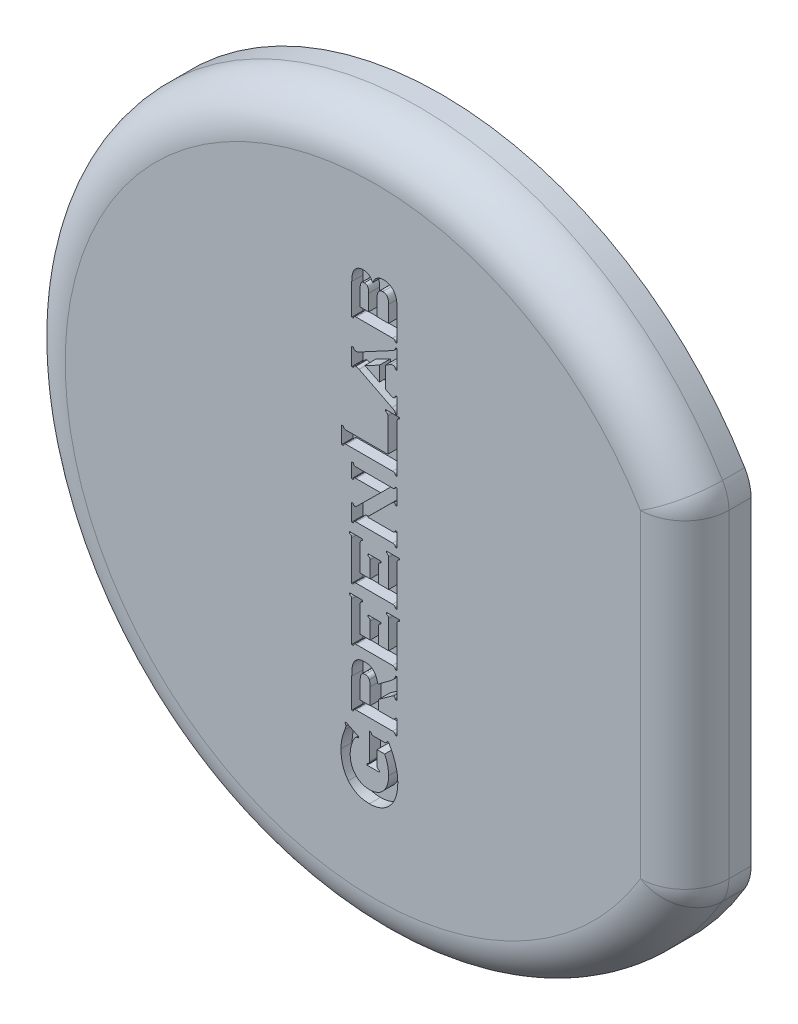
from build123d import *

# Parameters (mm, degrees)
BOSS_EXTRUDE1_DEPTH = 3
FILLET1_R           = 2
CUT_EXTRUDE1_DEPTH  = 0.5


with BuildPart() as part:
    # Sketch1 → Boss-Extrude1 (new body)
    with BuildSketch(Plane.XY.offset(3)):
        with BuildLine():
            Line((13.99999987, -7.745966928), (13.99999987, 7.745966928))
            ThreePointArc((13.99999987, 7.745966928), (-16, 0), (13.99999987, -7.745966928))
        make_face()
    extrude(amount=-BOSS_EXTRUDE1_DEPTH)

    # Fillet1
    fillet1_edges = [part.edges().sort_by_distance(p)[0] for p in [
        (13.99999987, 0, 3),
        (-16, 0, 3),
        (13.99999987, 7.745966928, 1.5),
        (13.99999987, -7.745966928, 1.5),
    ]]
    fillet(fillet1_edges, radius=FILLET1_R)

    # Sketch2 → Cut-Extrude1 (cut)
    # profile 1 of 8: a face of its own
    with BuildSketch(Plane.XY.offset(3)):
        with BuildLine():
            add(Edge.make_bspline(
                [(-0.100260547, 10.073784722), (-0.089010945, 10.097643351), (-0.067808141, 10.142611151), (-0.033016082, 10.203527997), (0.001276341, 10.254862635), (0.026751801, 10.283442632), (0.038628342, 10.296766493)],
                knots=[0, 0, 0, 0, 1.199284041, 2.260363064, 3.188989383, 4, 4, 4, 4], degree=3))
            add(Edge.make_bspline(
                [(0.038628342, 10.296766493), (0.049797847, 10.307685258), (0.072148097, 10.329533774), (0.109592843, 10.357737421), (0.150282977, 10.380996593), (0.193106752, 10.400928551), (0.239354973, 10.415332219), (0.28813888, 10.426235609), (0.339917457, 10.432843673), (0.375342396, 10.433627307), (0.39344605, 10.434027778)],
                knots=[0, 0, 0, 0, 0.957204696, 1.915372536, 2.864513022, 3.827290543, 4.805779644, 5.828215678, 6.89012558, 8, 8, 8, 8], degree=3))
            add(Edge.make_bspline(
                [(0.39344605, 10.434027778), (0.417720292, 10.433485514), (0.46505451, 10.432428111), (0.534000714, 10.421763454), (0.598795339, 10.404776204), (0.659040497, 10.379794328), (0.715409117, 10.349147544), (0.76679019, 10.310325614), (0.814590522, 10.265336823), (0.841835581, 10.230422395), (0.855685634, 10.212673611)],
                knots=[0, 0, 0, 0, 1.09149512, 2.128390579, 3.131133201, 4.098244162, 5.056171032, 6.009871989, 6.988316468, 8, 8, 8, 8], degree=3))
            add(Edge.make_bspline(
                [(0.855685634, 10.212673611), (0.867269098, 10.195719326), (0.890818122, 10.1612515), (0.91971378, 10.104415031), (0.944739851, 10.043451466), (0.965471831, 9.977997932), (0.98117097, 9.907740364), (0.99145066, 9.832766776), (0.999057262, 9.753300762), (0.999679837, 9.69873222), (0.99999987, 9.670681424)],
                knots=[0, 0, 0, 0, 0.863603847, 1.755694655, 2.67743618, 3.635676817, 4.642232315, 5.703768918, 6.81962927, 8, 8, 8, 8], degree=3))
            Line((0.99999987, 9.670681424), (0.99999987, 8.246527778))
            Line((0.99999987, 8.246527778), (0.930555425, 8.246527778))
            add(Edge.make_bspline(
                [(0.930555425, 8.246527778), (0.927624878, 8.255432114), (0.92214104, 8.272094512), (0.91220566, 8.29512164), (0.898959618, 8.312950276), (0.88435864, 8.327490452), (0.866809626, 8.337941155), (0.846629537, 8.345530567), (0.823124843, 8.349789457), (0.806513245, 8.350379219), (0.797634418, 8.350694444)],
                knots=[0, 0, 0, 0, 1.214308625, 2.272296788, 3.227641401, 4.072125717, 4.923398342, 5.849609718, 6.850625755, 8, 8, 8, 8], degree=3))
            Line((0.797634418, 8.350694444), (-0.84624579, 8.350694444))
            add(Edge.make_bspline(
                [(-0.84624579, 8.350694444), (-0.854925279, 8.350287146), (-0.871289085, 8.34951925), (-0.894640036, 8.3463678), (-0.914166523, 8.338319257), (-0.931547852, 8.328655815), (-0.945395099, 8.313813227), (-0.958696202, 8.295899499), (-0.969741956, 8.272713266), (-0.975891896, 8.255626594), (-0.979166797, 8.246527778)],
                knots=[0, 0, 0, 0, 1.128659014, 2.127908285, 3.03439063, 3.855433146, 4.685150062, 5.642745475, 6.744739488, 8, 8, 8, 8], degree=3))
            Line((-0.979166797, 8.246527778), (-1.048611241, 8.246527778))
            Line((-1.048611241, 8.246527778), (-1.048611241, 9.644097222))
            add(Edge.make_bspline(
                [(-1.048611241, 9.644097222), (-1.048249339, 9.673771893), (-1.047551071, 9.731027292), (-1.040687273, 9.813757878), (-1.031012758, 9.890568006), (-1.015611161, 9.961009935), (-0.996966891, 10.025633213), (-0.973377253, 10.08376899), (-0.946823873, 10.136854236), (-0.924088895, 10.167739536), (-0.912977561, 10.182834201)],
                knots=[0, 0, 0, 0, 1.259629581, 2.430375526, 3.522812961, 4.543893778, 5.488959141, 6.374407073, 7.205519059, 8, 8, 8, 8], degree=3))
            add(Edge.make_bspline(
                [(-0.912977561, 10.182834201), (-0.900839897, 10.197437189), (-0.876987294, 10.226134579), (-0.835830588, 10.263196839), (-0.791494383, 10.294406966), (-0.743941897, 10.320010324), (-0.693076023, 10.340467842), (-0.638655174, 10.354098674), (-0.58107891, 10.36332541), (-0.541560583, 10.364156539), (-0.521267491, 10.364583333)],
                knots=[0, 0, 0, 0, 1.01613969, 1.996889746, 2.956405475, 3.914354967, 4.883989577, 5.884961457, 6.913904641, 8, 8, 8, 8], degree=3))
            add(Edge.make_bspline(
                [(-0.521267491, 10.364583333), (-0.497869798, 10.364027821), (-0.45287656, 10.362959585), (-0.388992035, 10.350034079), (-0.331310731, 10.330302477), (-0.279700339, 10.30047346), (-0.232626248, 10.259995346), (-0.185927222, 10.209803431), (-0.142162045, 10.145931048), (-0.114760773, 10.098751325), (-0.100260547, 10.073784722)],
                knots=[0, 0, 0, 0, 1.030716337, 1.982044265, 2.862735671, 3.709827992, 4.593441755, 5.592771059, 6.726140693, 8, 8, 8, 8], degree=3))
        make_face()
        with BuildLine():
            Line((-0.284722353, 8.836805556), (-0.284722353, 9.563802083))
            add(Edge.make_bspline(
                [(-0.284722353, 9.563802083), (-0.28515783, 9.590409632), (-0.285963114, 9.639612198), (-0.293704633, 9.707131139), (-0.306632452, 9.762341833), (-0.325538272, 9.806236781), (-0.352005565, 9.839791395), (-0.386974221, 9.862780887), (-0.429491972, 9.876566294), (-0.460391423, 9.877811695), (-0.476779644, 9.878472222)],
                knots=[0, 0, 0, 0, 1.512131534, 2.796227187, 3.855933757, 4.725485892, 5.492963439, 6.248574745, 7.071092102, 8, 8, 8, 8], degree=3))
            add(Edge.make_bspline(
                [(-0.476779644, 9.878472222), (-0.492977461, 9.87778132), (-0.52327688, 9.876488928), (-0.565348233, 9.863204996), (-0.599723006, 9.840324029), (-0.626542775, 9.807289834), (-0.645385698, 9.763466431), (-0.65752425, 9.707955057), (-0.665481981, 9.640165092), (-0.666251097, 9.590594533), (-0.666666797, 9.563802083)],
                knots=[0, 0, 0, 0, 0.921305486, 1.723381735, 2.481162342, 3.2428606, 4.114909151, 5.17520465, 6.473222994, 8, 8, 8, 8], degree=3))
            Line((-0.666666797, 9.563802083), (-0.666666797, 8.836805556))
            Line((-0.666666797, 8.836805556), (-0.284722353, 8.836805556))
        make_face(mode=Mode.SUBTRACT)
        with BuildLine():
            Line((0.618055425, 8.836805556), (0.618055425, 9.585503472))
            add(Edge.make_bspline(
                [(0.618055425, 9.585503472), (0.617567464, 9.613961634), (0.616654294, 9.667218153), (0.603835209, 9.741379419), (0.584711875, 9.805026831), (0.55558837, 9.857173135), (0.518451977, 9.898832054), (0.471742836, 9.927276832), (0.417382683, 9.945659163), (0.378237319, 9.947138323), (0.357638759, 9.947916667)],
                knots=[0, 0, 0, 0, 1.344028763, 2.515211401, 3.548364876, 4.471249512, 5.318650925, 6.156286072, 7.02982502, 8, 8, 8, 8], degree=3))
            add(Edge.make_bspline(
                [(0.357638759, 9.947916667), (0.33724202, 9.947081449), (0.298145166, 9.945480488), (0.243707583, 9.927598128), (0.197368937, 9.898434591), (0.159495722, 9.857569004), (0.131462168, 9.804700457), (0.110998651, 9.741601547), (0.099583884, 9.66710476), (0.098044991, 9.613935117), (0.097222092, 9.585503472)],
                knots=[0, 0, 0, 0, 0.962178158, 1.844321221, 2.675172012, 3.52884247, 4.448055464, 5.484422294, 6.65483368, 8, 8, 8, 8], degree=3))
            Line((0.097222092, 9.585503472), (0.097222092, 8.836805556))
            Line((0.097222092, 8.836805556), (0.618055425, 8.836805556))
        make_face(mode=Mode.SUBTRACT)
    # profile 2 of 8: a face of its own
    with BuildSketch(Plane.XY.offset(3)):
        with BuildLine():
            Line((0.479166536, 7.139756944), (0.479166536, 6.189778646))
            Line((0.479166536, 6.189778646), (0.697808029, 6.076388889))
            add(Edge.make_bspline(
                [(0.697808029, 6.076388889), (0.710194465, 6.070547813), (0.733199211, 6.059699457), (0.766501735, 6.04799719), (0.795199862, 6.039237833), (0.813319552, 6.038294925), (0.821505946, 6.037868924)],
                knots=[0, 0, 0, 0, 1.258188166, 2.336773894, 3.248561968, 4, 4, 4, 4], degree=3))
            add(Edge.make_bspline(
                [(0.821505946, 6.037868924), (0.828408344, 6.038350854), (0.841712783, 6.039279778), (0.86083917, 6.044619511), (0.877715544, 6.05490056), (0.892105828, 6.069394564), (0.905732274, 6.086870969), (0.915504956, 6.109203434), (0.924324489, 6.134769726), (0.928402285, 6.153372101), (0.930555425, 6.163194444)],
                knots=[0, 0, 0, 0, 0.910861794, 1.755694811, 2.589696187, 3.483236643, 4.43677035, 5.49240796, 6.675952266, 8, 8, 8, 8], degree=3))
            Line((0.930555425, 6.163194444), (0.99999987, 6.163194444))
            Line((0.99999987, 6.163194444), (0.99999987, 5.434027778))
            Line((0.99999987, 5.434027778), (0.930555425, 5.434027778))
            add(Edge.make_bspline(
                [(0.930555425, 5.434027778), (0.92863422, 5.44493362), (0.924965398, 5.465759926), (0.915955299, 5.494265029), (0.904372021, 5.518473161), (0.889572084, 5.539329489), (0.868919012, 5.557799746), (0.842653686, 5.577587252), (0.808218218, 5.59762729), (0.78267328, 5.6111746), (0.768880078, 5.618489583)],
                knots=[0, 0, 0, 0, 1.025916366, 1.959137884, 2.761484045, 3.50604026, 4.312579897, 5.318573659, 6.552141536, 8, 8, 8, 8], degree=3))
            Line((0.768880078, 5.618489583), (-0.717122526, 6.372612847))
            add(Edge.make_bspline(
                [(-0.717122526, 6.372612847), (-0.730593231, 6.378969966), (-0.756223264, 6.391065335), (-0.794329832, 6.405131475), (-0.830195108, 6.412936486), (-0.8532687, 6.414291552), (-0.864149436, 6.414930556)],
                knots=[0, 0, 0, 0, 1.158371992, 2.203976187, 3.153055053, 4, 4, 4, 4], degree=3))
            add(Edge.make_bspline(
                [(-0.864149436, 6.414930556), (-0.875991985, 6.413638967), (-0.899999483, 6.411020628), (-0.932843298, 6.389677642), (-0.959427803, 6.355350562), (-0.972198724, 6.327205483), (-0.979166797, 6.311848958)],
                knots=[0, 0, 0, 0, 0.861054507, 1.745550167, 2.769926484, 4, 4, 4, 4], degree=3))
            Line((-0.979166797, 6.311848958), (-1.048611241, 6.311848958))
            Line((-1.048611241, 6.311848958), (-1.048611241, 7.109375))
            Line((-1.048611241, 7.109375), (-0.979166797, 7.109375))
            add(Edge.make_bspline(
                [(-0.979166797, 7.109375), (-0.972547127, 7.094246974), (-0.960247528, 7.066138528), (-0.931153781, 7.033348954), (-0.896161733, 7.012023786), (-0.870220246, 7.009659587), (-0.857096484, 7.008463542)],
                knots=[0, 0, 0, 0, 1.167592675, 2.169431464, 3.073918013, 4, 4, 4, 4], degree=3))
            add(Edge.make_bspline(
                [(-0.857096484, 7.008463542), (-0.846554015, 7.009009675), (-0.824064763, 7.01017469), (-0.789221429, 7.019868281), (-0.75093852, 7.033847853), (-0.72530655, 7.047034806), (-0.711697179, 7.054036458)],
                knots=[0, 0, 0, 0, 0.821709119, 1.75287438, 2.806881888, 4, 4, 4, 4], degree=3))
            Line((-0.711697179, 7.054036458), (0.729275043, 7.826605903))
            add(Edge.make_bspline(
                [(0.729275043, 7.826605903), (0.747231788, 7.836634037), (0.779999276, 7.854933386), (0.823701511, 7.881084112), (0.856648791, 7.904546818), (0.881475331, 7.925291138), (0.899227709, 7.947861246), (0.912533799, 7.973714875), (0.923645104, 8.00413268), (0.92815376, 8.026356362), (0.930555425, 8.038194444)],
                knots=[0, 0, 0, 0, 1.612697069, 2.942851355, 3.989484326, 4.783110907, 5.469570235, 6.224377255, 7.054163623, 8, 8, 8, 8], degree=3))
            Line((0.930555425, 8.038194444), (0.99999987, 8.038194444))
            Line((0.99999987, 8.038194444), (0.99999987, 7.1875))
            Line((0.99999987, 7.1875), (0.930555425, 7.1875))
            add(Edge.make_bspline(
                [(0.930555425, 7.1875), (0.928789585, 7.196778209), (0.92545036, 7.21432341), (0.917295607, 7.238424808), (0.907095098, 7.258902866), (0.894306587, 7.27554808), (0.879501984, 7.28914655), (0.861857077, 7.298221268), (0.842302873, 7.304003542), (0.828602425, 7.304454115), (0.821505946, 7.3046875)],
                knots=[0, 0, 0, 0, 1.280586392, 2.42160363, 3.442514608, 4.370371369, 5.257057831, 6.146457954, 7.039913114, 8, 8, 8, 8], degree=3))
            add(Edge.make_bspline(
                [(0.821505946, 7.3046875), (0.811686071, 7.304129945), (0.790622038, 7.302933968), (0.757691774, 7.293238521), (0.721554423, 7.278677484), (0.697144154, 7.26552331), (0.684244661, 7.258572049)],
                knots=[0, 0, 0, 0, 0.804870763, 1.726480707, 2.798569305, 4, 4, 4, 4], degree=3))
            Line((0.684244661, 7.258572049), (0.479166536, 7.139756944))
        make_face()
        Polygon((0.201388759, 6.994357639), (-0.453993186, 6.655815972), (0.201388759, 6.329210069), align=None, mode=Mode.SUBTRACT)
    # profile 3 of 8: a face of its own
    with BuildSketch(Plane.XY.offset(3)):
        with BuildLine():
            Line((0.583333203, 3.697916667), (0.583333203, 5.199110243))
            add(Edge.make_bspline(
                [(0.583333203, 5.199110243), (0.582916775, 5.207786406), (0.582131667, 5.224143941), (0.579116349, 5.247368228), (0.57082677, 5.266622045), (0.561291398, 5.283852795), (0.546594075, 5.297733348), (0.528459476, 5.310436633), (0.505323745, 5.320963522), (0.488263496, 5.326766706), (0.479166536, 5.329861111)],
                knots=[0, 0, 0, 0, 1.136312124, 2.142337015, 3.032986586, 3.859596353, 4.69493934, 5.645323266, 6.744426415, 8, 8, 8, 8], degree=3))
            Line((0.479166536, 5.329861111), (0.479166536, 5.399305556))
            Line((0.479166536, 5.399305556), (1.104166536, 5.399305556))
            Line((1.104166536, 5.399305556), (1.104166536, 5.329861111))
            add(Edge.make_bspline(
                [(1.104166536, 5.329861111), (1.095045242, 5.326811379), (1.078093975, 5.321143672), (1.055256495, 5.310106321), (1.036776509, 5.297928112), (1.022106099, 5.283813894), (1.012341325, 5.266753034), (1.005013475, 5.24700354), (1.000990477, 5.223862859), (1.000340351, 5.2072619), (0.99999987, 5.198567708)],
                knots=[0, 0, 0, 0, 1.252901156, 2.328426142, 3.296223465, 4.129788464, 4.954638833, 5.834908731, 6.866106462, 8, 8, 8, 8], degree=3))
            Line((0.99999987, 5.198567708), (0.99999987, 3.038194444))
            Line((0.99999987, 3.038194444), (0.930555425, 3.038194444))
            add(Edge.make_bspline(
                [(0.930555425, 3.038194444), (0.927464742, 3.047295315), (0.92166854, 3.0643629), (0.911096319, 3.087450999), (0.898459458, 3.105839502), (0.884012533, 3.120138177), (0.866676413, 3.130021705), (0.847102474, 3.138022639), (0.823586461, 3.141217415), (0.807038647, 3.141962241), (0.798176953, 3.142361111)],
                knots=[0, 0, 0, 0, 1.245850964, 2.336443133, 3.279467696, 4.125082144, 4.945291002, 5.850852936, 6.849087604, 8, 8, 8, 8], degree=3))
            Line((0.798176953, 3.142361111), (-1.298177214, 3.142361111))
            add(Edge.make_bspline(
                [(-1.298177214, 3.142361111), (-1.307041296, 3.141970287), (-1.323593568, 3.141240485), (-1.347248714, 3.137923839), (-1.367060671, 3.130125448), (-1.3845368, 3.120292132), (-1.39843119, 3.105630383), (-1.411130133, 3.087484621), (-1.421658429, 3.064352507), (-1.427461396, 3.047291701), (-1.430555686, 3.038194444)],
                knots=[0, 0, 0, 0, 1.150172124, 2.147764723, 3.074619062, 3.894300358, 4.722641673, 5.665059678, 6.754950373, 8, 8, 8, 8], degree=3))
            Line((-1.430555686, 3.038194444), (-1.50000013, 3.038194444))
            Line((-1.50000013, 3.038194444), (-1.50000013, 3.802083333))
            Line((-1.50000013, 3.802083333), (-1.430555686, 3.802083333))
            add(Edge.make_bspline(
                [(-1.430555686, 3.802083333), (-1.427672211, 3.792973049), (-1.422321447, 3.776067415), (-1.411931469, 3.753077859), (-1.39970519, 3.734505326), (-1.384993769, 3.720025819), (-1.367298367, 3.710117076), (-1.346901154, 3.703132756), (-1.323308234, 3.698831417), (-1.30651537, 3.698233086), (-1.297634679, 3.697916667)],
                knots=[0, 0, 0, 0, 1.231701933, 2.285625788, 3.242999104, 4.084239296, 4.920290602, 5.83495028, 6.855041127, 8, 8, 8, 8], degree=3))
            Line((-1.297634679, 3.697916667), (0.583333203, 3.697916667))
        make_face()
    # profile 4 of 8: a face of its own
    with BuildSketch(Plane.XY.offset(3)):
        with BuildLine():
            Line((-0.343858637, 0.78125), (0.796006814, 0.78125))
            add(Edge.make_bspline(
                [(0.796006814, 0.78125), (0.804893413, 0.781544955), (0.821519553, 0.782096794), (0.844867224, 0.786594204), (0.865310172, 0.793319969), (0.882883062, 0.804126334), (0.897818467, 0.818597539), (0.910319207, 0.837278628), (0.921848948, 0.859595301), (0.927534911, 0.876458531), (0.930555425, 0.885416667)],
                knots=[0, 0, 0, 0, 1.143670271, 2.139718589, 3.053348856, 3.900396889, 4.773630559, 5.710721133, 6.783882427, 8, 8, 8, 8], degree=3))
            Line((0.930555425, 0.885416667), (0.99999987, 0.885416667))
            Line((0.99999987, 0.885416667), (0.99999987, 0.225694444))
            Line((0.99999987, 0.225694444), (0.930555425, 0.225694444))
            add(Edge.make_bspline(
                [(0.930555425, 0.225694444), (0.927624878, 0.23459878), (0.92214104, 0.251261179), (0.91220566, 0.274288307), (0.898959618, 0.292116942), (0.88435864, 0.306657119), (0.866809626, 0.317107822), (0.846629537, 0.324697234), (0.823124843, 0.328956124), (0.806513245, 0.329545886), (0.797634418, 0.329861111)],
                knots=[0, 0, 0, 0, 1.214308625, 2.272296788, 3.227641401, 4.072125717, 4.923398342, 5.849609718, 6.850625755, 8, 8, 8, 8], degree=3))
            Line((0.797634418, 0.329861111), (-0.84624579, 0.329861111))
            add(Edge.make_bspline(
                [(-0.84624579, 0.329861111), (-0.854925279, 0.329453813), (-0.871289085, 0.328685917), (-0.894640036, 0.325534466), (-0.914166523, 0.317485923), (-0.931547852, 0.307822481), (-0.945395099, 0.292979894), (-0.958696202, 0.275066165), (-0.969741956, 0.251879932), (-0.975891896, 0.23479326), (-0.979166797, 0.225694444)],
                knots=[0, 0, 0, 0, 1.128659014, 2.127908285, 3.03439063, 3.855433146, 4.685150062, 5.642745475, 6.744739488, 8, 8, 8, 8], degree=3))
            Line((-0.979166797, 0.225694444), (-1.048611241, 0.225694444))
            Line((-1.048611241, 0.225694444), (-1.048611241, 0.996636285))
            Line((-1.048611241, 0.996636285), (-0.979166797, 0.996636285))
            add(Edge.make_bspline(
                [(-0.979166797, 0.996636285), (-0.975709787, 0.984845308), (-0.969545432, 0.963820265), (-0.95419583, 0.937700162), (-0.933666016, 0.920119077), (-0.917239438, 0.918312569), (-0.909179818, 0.917426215)],
                knots=[0, 0, 0, 0, 1.287745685, 2.296239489, 3.164058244, 4, 4, 4, 4], degree=3))
            add(Edge.make_bspline(
                [(-0.909179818, 0.917426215), (-0.901664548, 0.918315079), (-0.885251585, 0.920256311), (-0.860677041, 0.93229719), (-0.834452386, 0.950467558), (-0.817813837, 0.966344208), (-0.808810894, 0.974934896)],
                knots=[0, 0, 0, 0, 0.763994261, 1.668524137, 2.738463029, 4, 4, 4, 4], degree=3))
            Line((-0.808810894, 0.974934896), (0.261067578, 2.03125))
            Line((0.261067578, 2.03125), (-0.84624579, 2.03125))
            add(Edge.make_bspline(
                [(-0.84624579, 2.03125), (-0.854922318, 2.030826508), (-0.871458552, 2.030019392), (-0.895025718, 2.027028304), (-0.914829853, 2.018745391), (-0.932556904, 2.009216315), (-0.94705731, 1.994704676), (-0.959712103, 1.976347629), (-0.970278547, 1.953249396), (-0.97607564, 1.936183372), (-0.979166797, 1.927083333)],
                knots=[0, 0, 0, 0, 1.124712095, 2.143541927, 3.046854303, 3.885165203, 4.728679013, 5.669360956, 6.757243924, 8, 8, 8, 8], degree=3))
            Line((-0.979166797, 1.927083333), (-1.048611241, 1.927083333))
            Line((-1.048611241, 1.927083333), (-1.048611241, 2.586805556))
            Line((-1.048611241, 2.586805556), (-0.979166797, 2.586805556))
            add(Edge.make_bspline(
                [(-0.979166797, 2.586805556), (-0.97612027, 2.577681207), (-0.970458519, 2.560724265), (-0.95938259, 2.537923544), (-0.947256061, 2.519218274), (-0.932517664, 2.504738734), (-0.914959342, 2.494970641), (-0.894828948, 2.487743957), (-0.871547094, 2.483611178), (-0.854942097, 2.482973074), (-0.84624579, 2.482638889)],
                knots=[0, 0, 0, 0, 1.243685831, 2.311300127, 3.271979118, 4.116123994, 4.955062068, 5.850833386, 6.874446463, 8, 8, 8, 8], degree=3))
            Line((-0.84624579, 2.482638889), (0.796006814, 2.482638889))
            add(Edge.make_bspline(
                [(0.796006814, 2.482638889), (0.804704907, 2.482969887), (0.821313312, 2.483601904), (0.844572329, 2.487775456), (0.864628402, 2.494819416), (0.881819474, 2.504913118), (0.896499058, 2.519320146), (0.90908097, 2.538006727), (0.921467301, 2.560518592), (0.927388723, 2.57764602), (0.930555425, 2.586805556)],
                knots=[0, 0, 0, 0, 1.122381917, 2.143110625, 3.036357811, 3.852834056, 4.694600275, 5.665840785, 6.751720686, 8, 8, 8, 8], degree=3))
            Line((0.930555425, 2.586805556), (0.99999987, 2.586805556))
            Line((0.99999987, 2.586805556), (0.99999987, 1.868489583))
            Line((0.99999987, 1.868489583), (0.930555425, 1.868489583))
            add(Edge.make_bspline(
                [(0.930555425, 1.868489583), (0.927588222, 1.880040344), (0.922238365, 1.900866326), (0.908685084, 1.927214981), (0.888616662, 1.944467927), (0.87278307, 1.946263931), (0.864908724, 1.947157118)],
                knots=[0, 0, 0, 0, 1.28387963, 2.314830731, 3.161933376, 4, 4, 4, 4], degree=3))
            add(Edge.make_bspline(
                [(0.864908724, 1.947157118), (0.856201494, 1.945940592), (0.837083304, 1.943269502), (0.814902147, 1.927811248), (0.794096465, 1.909162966), (0.7709571, 1.888298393), (0.741411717, 1.860348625), (0.71999968, 1.839067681), (0.708116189, 1.827256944)],
                knots=[0, 0, 0, 0, 0.778870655, 1.71014178, 2.353616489, 3.294570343, 4.498510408, 6, 6, 6, 6], degree=3))
            Line((0.708116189, 1.827256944), (-0.343858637, 0.78125))
        make_face()
    # profile 5 of 8: a face of its own
    with BuildSketch(Plane.XY.offset(3)):
        with BuildLine():
            Line((0.166666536, -1.579861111), (0.618055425, -1.579861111))
            Line((0.618055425, -1.579861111), (0.618055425, -0.32172309))
            add(Edge.make_bspline(
                [(0.618055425, -0.32172309), (0.617667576, -0.313037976), (0.616944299, -0.296841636), (0.613600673, -0.273737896), (0.605884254, -0.254387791), (0.595640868, -0.237452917), (0.581559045, -0.223053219), (0.563137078, -0.210436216), (0.54005976, -0.199857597), (0.522990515, -0.19406238), (0.513888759, -0.190972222)],
                knots=[0, 0, 0, 0, 1.136968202, 2.120262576, 3.033418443, 3.84032541, 4.69303108, 5.643963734, 6.743701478, 8, 8, 8, 8], degree=3))
            Line((0.513888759, -0.190972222), (0.513888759, -0.121527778))
            Line((0.513888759, -0.121527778), (1.104166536, -0.121527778))
            Line((1.104166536, -0.121527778), (1.104166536, -0.190972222))
            add(Edge.make_bspline(
                [(1.104166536, -0.190972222), (1.095210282, -0.193605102), (1.078327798, -0.198568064), (1.055885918, -0.209514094), (1.037544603, -0.222113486), (1.022893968, -0.236422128), (1.011944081, -0.253615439), (1.005367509, -0.273958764), (1.000874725, -0.29711414), (1.000302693, -0.313559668), (0.99999987, -0.322265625)],
                knots=[0, 0, 0, 0, 1.21379651, 2.287998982, 3.235193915, 4.101035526, 4.937230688, 5.860712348, 6.867500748, 8, 8, 8, 8], degree=3))
            Line((0.99999987, -0.322265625), (0.99999987, -2.170138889))
            Line((0.99999987, -2.170138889), (0.930555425, -2.170138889))
            add(Edge.make_bspline(
                [(0.930555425, -2.170138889), (0.927624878, -2.161234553), (0.92214104, -2.144572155), (0.91220566, -2.121545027), (0.898959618, -2.103716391), (0.88435864, -2.089176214), (0.866809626, -2.078725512), (0.846629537, -2.0711361), (0.823124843, -2.06687721), (0.806513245, -2.066287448), (0.797634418, -2.065972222)],
                knots=[0, 0, 0, 0, 1.214308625, 2.272296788, 3.227641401, 4.072125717, 4.923398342, 5.849609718, 6.850625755, 8, 8, 8, 8], degree=3))
            Line((0.797634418, -2.065972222), (-0.84624579, -2.065972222))
            add(Edge.make_bspline(
                [(-0.84624579, -2.065972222), (-0.854925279, -2.06637952), (-0.871289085, -2.067147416), (-0.894640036, -2.070298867), (-0.914166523, -2.07834741), (-0.931547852, -2.088010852), (-0.945395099, -2.10285344), (-0.958696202, -2.120767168), (-0.969741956, -2.143953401), (-0.975891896, -2.161040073), (-0.979166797, -2.170138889)],
                knots=[0, 0, 0, 0, 1.128659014, 2.127908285, 3.03439063, 3.855433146, 4.685150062, 5.642745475, 6.744739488, 8, 8, 8, 8], degree=3))
            Line((-0.979166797, -2.170138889), (-1.048611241, -2.170138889))
            Line((-1.048611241, -2.170138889), (-1.048611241, -0.392252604))
            add(Edge.make_bspline(
                [(-1.048611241, -0.392252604), (-1.049010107, -0.383390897), (-1.049754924, -0.366843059), (-1.052949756, -0.343327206), (-1.060950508, -0.323752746), (-1.070834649, -0.306418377), (-1.085130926, -0.291964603), (-1.103529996, -0.279357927), (-1.126514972, -0.268671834), (-1.143661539, -0.263282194), (-1.152777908, -0.260416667)],
                knots=[0, 0, 0, 0, 1.152027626, 2.151229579, 3.057668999, 3.878672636, 4.725106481, 5.669044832, 6.76069378, 8, 8, 8, 8], degree=3))
            Line((-1.152777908, -0.260416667), (-1.152777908, -0.190972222))
            Line((-1.152777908, -0.190972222), (-0.56250013, -0.190972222))
            Line((-0.56250013, -0.190972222), (-0.56250013, -0.260416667))
            add(Edge.make_bspline(
                [(-0.56250013, -0.260416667), (-0.571625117, -0.263269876), (-0.588787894, -0.268636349), (-0.611802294, -0.279537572), (-0.630642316, -0.291780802), (-0.644946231, -0.306447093), (-0.654859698, -0.323503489), (-0.662334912, -0.343226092), (-0.665477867, -0.36647865), (-0.666257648, -0.383027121), (-0.666666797, -0.391710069)],
                knots=[0, 0, 0, 0, 1.241043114, 2.334222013, 3.298856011, 4.146476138, 4.968630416, 5.84602308, 6.869812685, 8, 8, 8, 8], degree=3))
            Line((-0.666666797, -0.391710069), (-0.666666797, -1.579861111))
            Line((-0.666666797, -1.579861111), (-0.215277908, -1.579861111))
            Line((-0.215277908, -1.579861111), (-0.215277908, -0.842556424))
            add(Edge.make_bspline(
                [(-0.215277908, -0.842556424), (-0.215682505, -0.834055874), (-0.216444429, -0.818047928), (-0.219621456, -0.795248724), (-0.227586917, -0.77617948), (-0.237681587, -0.759371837), (-0.251765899, -0.744948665), (-0.27031775, -0.732419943), (-0.293212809, -0.721171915), (-0.310329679, -0.715060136), (-0.319444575, -0.711805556)],
                knots=[0, 0, 0, 0, 1.117146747, 2.103772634, 2.997955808, 3.807596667, 4.6631914, 5.617345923, 6.731213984, 8, 8, 8, 8], degree=3))
            Line((-0.319444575, -0.711805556), (-0.319444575, -0.642361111))
            Line((-0.319444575, -0.642361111), (0.270833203, -0.642361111))
            Line((0.270833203, -0.642361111), (0.270833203, -0.711805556))
            add(Edge.make_bspline(
                [(0.270833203, -0.711805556), (0.261883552, -0.714651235), (0.245062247, -0.719999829), (0.22248686, -0.731044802), (0.203937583, -0.743163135), (0.189395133, -0.757469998), (0.178894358, -0.774190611), (0.171727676, -0.79415012), (0.167643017, -0.817252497), (0.167002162, -0.833859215), (0.166666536, -0.842556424)],
                knots=[0, 0, 0, 0, 1.225527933, 2.303439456, 3.273384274, 4.108798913, 4.947881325, 5.830104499, 6.863590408, 8, 8, 8, 8], degree=3))
            Line((0.166666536, -0.842556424), (0.166666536, -1.579861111))
        make_face()
    # profile 6 of 8: a face of its own
    with BuildSketch(Plane.XY.offset(3)):
        with BuildLine():
            Line((0.166666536, -3.975694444), (0.618055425, -3.975694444))
            Line((0.618055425, -3.975694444), (0.618055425, -2.717556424))
            add(Edge.make_bspline(
                [(0.618055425, -2.717556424), (0.617667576, -2.708871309), (0.616944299, -2.692674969), (0.613600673, -2.669571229), (0.605884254, -2.650221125), (0.595640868, -2.633286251), (0.581559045, -2.618886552), (0.563137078, -2.606269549), (0.54005976, -2.59569093), (0.522990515, -2.589895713), (0.513888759, -2.586805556)],
                knots=[0, 0, 0, 0, 1.136968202, 2.120262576, 3.033418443, 3.84032541, 4.69303108, 5.643963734, 6.743701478, 8, 8, 8, 8], degree=3))
            Line((0.513888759, -2.586805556), (0.513888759, -2.517361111))
            Line((0.513888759, -2.517361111), (1.104166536, -2.517361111))
            Line((1.104166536, -2.517361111), (1.104166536, -2.586805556))
            add(Edge.make_bspline(
                [(1.104166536, -2.586805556), (1.095210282, -2.589438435), (1.078327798, -2.594401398), (1.055885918, -2.605347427), (1.037544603, -2.61794682), (1.022893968, -2.632255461), (1.011944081, -2.649448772), (1.005367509, -2.669792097), (1.000874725, -2.692947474), (1.000302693, -2.709393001), (0.99999987, -2.718098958)],
                knots=[0, 0, 0, 0, 1.21379651, 2.287998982, 3.235193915, 4.101035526, 4.937230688, 5.860712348, 6.867500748, 8, 8, 8, 8], degree=3))
            Line((0.99999987, -2.718098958), (0.99999987, -4.565972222))
            Line((0.99999987, -4.565972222), (0.930555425, -4.565972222))
            add(Edge.make_bspline(
                [(0.930555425, -4.565972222), (0.927624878, -4.557067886), (0.92214104, -4.540405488), (0.91220566, -4.51737836), (0.898959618, -4.499549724), (0.88435864, -4.485009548), (0.866809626, -4.474558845), (0.846629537, -4.466969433), (0.823124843, -4.462710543), (0.806513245, -4.462120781), (0.797634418, -4.461805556)],
                knots=[0, 0, 0, 0, 1.214308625, 2.272296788, 3.227641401, 4.072125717, 4.923398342, 5.849609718, 6.850625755, 8, 8, 8, 8], degree=3))
            Line((0.797634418, -4.461805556), (-0.84624579, -4.461805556))
            add(Edge.make_bspline(
                [(-0.84624579, -4.461805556), (-0.854925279, -4.462212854), (-0.871289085, -4.46298075), (-0.894640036, -4.4661322), (-0.914166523, -4.474180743), (-0.931547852, -4.483844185), (-0.945395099, -4.498686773), (-0.958696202, -4.516600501), (-0.969741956, -4.539786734), (-0.975891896, -4.556873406), (-0.979166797, -4.565972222)],
                knots=[0, 0, 0, 0, 1.128659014, 2.127908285, 3.03439063, 3.855433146, 4.685150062, 5.642745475, 6.744739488, 8, 8, 8, 8], degree=3))
            Line((-0.979166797, -4.565972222), (-1.048611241, -4.565972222))
            Line((-1.048611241, -4.565972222), (-1.048611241, -2.788085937))
            add(Edge.make_bspline(
                [(-1.048611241, -2.788085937), (-1.049010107, -2.77922423), (-1.049754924, -2.762676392), (-1.052949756, -2.739160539), (-1.060950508, -2.719586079), (-1.070834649, -2.70225171), (-1.085130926, -2.687797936), (-1.103529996, -2.67519126), (-1.126514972, -2.664505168), (-1.143661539, -2.659115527), (-1.152777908, -2.65625)],
                knots=[0, 0, 0, 0, 1.152027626, 2.151229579, 3.057668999, 3.878672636, 4.725106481, 5.669044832, 6.76069378, 8, 8, 8, 8], degree=3))
            Line((-1.152777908, -2.65625), (-1.152777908, -2.586805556))
            Line((-1.152777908, -2.586805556), (-0.56250013, -2.586805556))
            Line((-0.56250013, -2.586805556), (-0.56250013, -2.65625))
            add(Edge.make_bspline(
                [(-0.56250013, -2.65625), (-0.571625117, -2.65910321), (-0.588787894, -2.664469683), (-0.611802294, -2.675370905), (-0.630642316, -2.687614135), (-0.644946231, -2.702280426), (-0.654859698, -2.719336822), (-0.662334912, -2.739059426), (-0.665477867, -2.762311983), (-0.666257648, -2.778860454), (-0.666666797, -2.787543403)],
                knots=[0, 0, 0, 0, 1.241043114, 2.334222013, 3.298856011, 4.146476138, 4.968630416, 5.84602308, 6.869812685, 8, 8, 8, 8], degree=3))
            Line((-0.666666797, -2.787543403), (-0.666666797, -3.975694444))
            Line((-0.666666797, -3.975694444), (-0.215277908, -3.975694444))
            Line((-0.215277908, -3.975694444), (-0.215277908, -3.238389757))
            add(Edge.make_bspline(
                [(-0.215277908, -3.238389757), (-0.215682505, -3.229889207), (-0.216444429, -3.213881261), (-0.219621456, -3.191082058), (-0.227586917, -3.172012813), (-0.237681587, -3.155205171), (-0.251765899, -3.140781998), (-0.27031775, -3.128253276), (-0.293212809, -3.117005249), (-0.310329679, -3.11089347), (-0.319444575, -3.107638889)],
                knots=[0, 0, 0, 0, 1.117146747, 2.103772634, 2.997955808, 3.807596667, 4.6631914, 5.617345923, 6.731213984, 8, 8, 8, 8], degree=3))
            Line((-0.319444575, -3.107638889), (-0.319444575, -3.038194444))
            Line((-0.319444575, -3.038194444), (0.270833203, -3.038194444))
            Line((0.270833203, -3.038194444), (0.270833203, -3.107638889))
            add(Edge.make_bspline(
                [(0.270833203, -3.107638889), (0.261883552, -3.110484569), (0.245062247, -3.115833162), (0.22248686, -3.126878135), (0.203937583, -3.138996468), (0.189395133, -3.153303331), (0.178894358, -3.170023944), (0.171727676, -3.189983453), (0.167643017, -3.213085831), (0.167002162, -3.229692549), (0.166666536, -3.238389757)],
                knots=[0, 0, 0, 0, 1.225527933, 2.303439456, 3.273384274, 4.108798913, 4.947881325, 5.830104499, 6.863590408, 8, 8, 8, 8], degree=3))
            Line((0.166666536, -3.238389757), (0.166666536, -3.975694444))
        make_face()
    # profile 7 of 8: a face of its own
    with BuildSketch(Plane.XY.offset(3)):
        with BuildLine():
            Line((0.166666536, -6.545138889), (0.798176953, -6.545138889))
            add(Edge.make_bspline(
                [(0.798176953, -6.545138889), (0.806883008, -6.544844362), (0.823150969, -6.544294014), (0.845966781, -6.539805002), (0.865631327, -6.533126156), (0.88243118, -6.522675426), (0.897027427, -6.508468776), (0.909708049, -6.489904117), (0.921327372, -6.467093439), (0.927330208, -6.450101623), (0.930555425, -6.440972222)],
                knots=[0, 0, 0, 0, 1.133233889, 2.117538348, 3.019422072, 3.823678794, 4.673583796, 5.654214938, 6.739651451, 8, 8, 8, 8], degree=3))
            Line((0.930555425, -6.440972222), (0.99999987, -6.440972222))
            Line((0.99999987, -6.440972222), (0.99999987, -7.135416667))
            Line((0.99999987, -7.135416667), (0.930555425, -7.135416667))
            add(Edge.make_bspline(
                [(0.930555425, -7.135416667), (0.927624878, -7.126512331), (0.92214104, -7.109849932), (0.91220566, -7.086822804), (0.898959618, -7.068994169), (0.88435864, -7.054453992), (0.866809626, -7.04400329), (0.846629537, -7.036413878), (0.823124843, -7.032154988), (0.806513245, -7.031565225), (0.797634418, -7.03125)],
                knots=[0, 0, 0, 0, 1.214308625, 2.272296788, 3.227641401, 4.072125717, 4.923398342, 5.849609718, 6.850625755, 8, 8, 8, 8], degree=3))
            Line((0.797634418, -7.03125), (-0.84624579, -7.03125))
            add(Edge.make_bspline(
                [(-0.84624579, -7.03125), (-0.854925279, -7.031657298), (-0.871289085, -7.032425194), (-0.894640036, -7.035576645), (-0.914166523, -7.043625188), (-0.931547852, -7.05328863), (-0.945395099, -7.068131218), (-0.958696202, -7.086044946), (-0.969741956, -7.109231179), (-0.975891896, -7.126317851), (-0.979166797, -7.135416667)],
                knots=[0, 0, 0, 0, 1.128659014, 2.127908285, 3.03439063, 3.855433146, 4.685150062, 5.642745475, 6.744739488, 8, 8, 8, 8], degree=3))
            Line((-0.979166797, -7.135416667), (-1.048611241, -7.135416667))
            Line((-1.048611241, -7.135416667), (-1.048611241, -5.805121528))
            add(Edge.make_bspline(
                [(-1.048611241, -5.805121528), (-1.048345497, -5.764425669), (-1.047848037, -5.688244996), (-1.043076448, -5.581644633), (-1.035381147, -5.49052543), (-1.024083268, -5.412677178), (-1.008125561, -5.344095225), (-0.986250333, -5.281402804), (-0.959815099, -5.221916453), (-0.937608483, -5.185333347), (-0.926540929, -5.167100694)],
                knots=[0, 0, 0, 0, 1.481606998, 2.773496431, 3.884065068, 4.809673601, 5.635344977, 6.4432619, 7.224137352, 8, 8, 8, 8], degree=3))
            add(Edge.make_bspline(
                [(-0.926540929, -5.167100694), (-0.91400292, -5.14952592), (-0.889267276, -5.114853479), (-0.844040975, -5.070084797), (-0.793462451, -5.032156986), (-0.737111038, -5.000947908), (-0.674700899, -4.977325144), (-0.607050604, -4.959934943), (-0.533708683, -4.949495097), (-0.482963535, -4.948454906), (-0.456705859, -4.947916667)],
                knots=[0, 0, 0, 0, 0.954938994, 1.883953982, 2.805234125, 3.748304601, 4.727237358, 5.753162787, 6.837391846, 8, 8, 8, 8], degree=3))
            add(Edge.make_bspline(
                [(-0.456705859, -4.947916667), (-0.436614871, -4.948315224), (-0.39740759, -4.949093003), (-0.340219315, -4.955673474), (-0.286560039, -4.966568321), (-0.235979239, -4.98090752), (-0.189342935, -5.000835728), (-0.145322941, -5.023983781), (-0.105335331, -5.052390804), (-0.068294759, -5.084833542), (-0.034654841, -5.122234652), (-0.002713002, -5.164203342), (0.02549283, -5.212018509), (0.051929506, -5.264713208), (0.075390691, -5.322723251), (0.097290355, -5.38582309), (0.116137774, -5.454399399), (0.12656337, -5.502153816), (0.131944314, -5.526801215)],
                knots=[0, 0, 0, 0, 1.054974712, 2.05876829, 3.018077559, 3.928757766, 4.81427522, 5.67693176, 6.535972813, 7.383915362, 8.257948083, 9.17356801, 10.149288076, 11.168732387, 12.267602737, 13.433048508, 14.67512408, 16, 16, 16, 16], degree=3))
            Line((0.131944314, -5.526801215), (0.667426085, -5.129665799))
            add(Edge.make_bspline(
                [(0.667426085, -5.129665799), (0.689839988, -5.112698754), (0.731291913, -5.081320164), (0.786055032, -5.035027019), (0.830188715, -4.995141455), (0.863747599, -4.958846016), (0.888893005, -4.923640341), (0.907986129, -4.887516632), (0.922472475, -4.849246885), (0.927846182, -4.822508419), (0.930555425, -4.809027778)],
                knots=[0, 0, 0, 0, 1.582811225, 2.927226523, 4.03709032, 4.931114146, 5.705394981, 6.46623019, 7.226724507, 8, 8, 8, 8], degree=3))
            Line((0.930555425, -4.809027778), (0.99999987, -4.809027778))
            Line((0.99999987, -4.809027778), (0.99999987, -5.734049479))
            Line((0.99999987, -5.734049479), (0.930555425, -5.734049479))
            add(Edge.make_bspline(
                [(0.930555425, -5.734049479), (0.92646933, -5.71931759), (0.919183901, -5.69305092), (0.901361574, -5.660889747), (0.878880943, -5.638283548), (0.86022462, -5.635900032), (0.851345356, -5.634765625)],
                knots=[0, 0, 0, 0, 1.338390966, 2.386324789, 3.231989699, 4, 4, 4, 4], degree=3))
            add(Edge.make_bspline(
                [(0.851345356, -5.634765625), (0.843818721, -5.635642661), (0.826572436, -5.637652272), (0.799723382, -5.651759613), (0.767187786, -5.670711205), (0.745156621, -5.688140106), (0.733072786, -5.697699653)],
                knots=[0, 0, 0, 0, 0.664756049, 1.523200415, 2.641504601, 4, 4, 4, 4], degree=3))
            Line((0.733072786, -5.697699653), (0.166666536, -6.106228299))
            Line((0.166666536, -6.106228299), (0.166666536, -6.545138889))
        make_face()
        with BuildLine():
            Line((-0.215277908, -6.545138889), (-0.215277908, -5.799696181))
            add(Edge.make_bspline(
                [(-0.215277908, -5.799696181), (-0.215630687, -5.773272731), (-0.216289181, -5.723950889), (-0.222617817, -5.655372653), (-0.232919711, -5.597347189), (-0.245414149, -5.563751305), (-0.2510852, -5.548502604)],
                knots=[0, 0, 0, 0, 1.241709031, 2.317766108, 3.236457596, 4, 4, 4, 4], degree=3))
            add(Edge.make_bspline(
                [(-0.2510852, -5.548502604), (-0.25534838, -5.539494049), (-0.263674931, -5.521899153), (-0.280299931, -5.498445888), (-0.299120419, -5.477813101), (-0.322151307, -5.461971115), (-0.347808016, -5.449534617), (-0.376241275, -5.440237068), (-0.407664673, -5.434729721), (-0.429555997, -5.434268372), (-0.440972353, -5.434027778)],
                knots=[0, 0, 0, 0, 1.008030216, 1.968815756, 2.902121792, 3.822384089, 4.781245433, 5.783764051, 6.844229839, 8, 8, 8, 8], degree=3))
            add(Edge.make_bspline(
                [(-0.440972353, -5.434027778), (-0.460619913, -5.43475556), (-0.497355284, -5.436116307), (-0.547846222, -5.451466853), (-0.588925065, -5.477177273), (-0.614865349, -5.507587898), (-0.629242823, -5.53723434), (-0.640081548, -5.562905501), (-0.647557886, -5.592999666), (-0.654881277, -5.626764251), (-0.660059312, -5.664499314), (-0.663659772, -5.706149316), (-0.666701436, -5.751548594), (-0.666678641, -5.783233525), (-0.666666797, -5.799696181)],
                knots=[0, 0, 0, 0, 1.425165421, 2.66465546, 3.788225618, 4.907941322, 5.513716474, 6.180377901, 6.930065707, 7.763120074, 8.692993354, 9.696653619, 10.803241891, 12, 12, 12, 12], degree=3))
            Line((-0.666666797, -5.799696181), (-0.666666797, -6.545138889))
            Line((-0.666666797, -6.545138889), (-0.215277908, -6.545138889))
        make_face(mode=Mode.SUBTRACT)
    # profile 8 of 8: a face of its own
    with BuildSketch(Plane.XY.offset(3)):
        with BuildLine():
            Line((0.097222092, -8.107638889), (0.097222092, -8.736979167))
            add(Edge.make_bspline(
                [(0.097222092, -8.736979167), (0.097542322, -8.746039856), (0.09814846, -8.763190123), (0.102383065, -8.78715412), (0.109299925, -8.807614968), (0.119355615, -8.824921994), (0.133976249, -8.839084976), (0.152618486, -8.851135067), (0.175151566, -8.86295877), (0.192236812, -8.868538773), (0.201388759, -8.871527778)],
                knots=[0, 0, 0, 0, 1.162769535, 2.20091524, 3.111292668, 3.923438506, 4.744164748, 5.697055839, 6.76639631, 8, 8, 8, 8], degree=3))
            Line((0.201388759, -8.871527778), (0.201388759, -8.940972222))
            Line((0.201388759, -8.940972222), (-0.354166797, -8.940972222))
            Line((-0.354166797, -8.940972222), (-0.354166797, -8.871527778))
            add(Edge.make_bspline(
                [(-0.354166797, -8.871527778), (-0.344825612, -8.868550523), (-0.327374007, -8.862988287), (-0.304660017, -8.851119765), (-0.285489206, -8.839867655), (-0.271801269, -8.825309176), (-0.261508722, -8.808779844), (-0.254478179, -8.788833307), (-0.251123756, -8.765302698), (-0.250389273, -8.748561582), (-0.25000013, -8.73969184)],
                knots=[0, 0, 0, 0, 1.267855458, 2.368662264, 3.318017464, 4.130433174, 4.930580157, 5.827855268, 6.849158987, 8, 8, 8, 8], degree=3))
            Line((-0.25000013, -8.73969184), (-0.25000013, -7.552083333))
            Line((-0.25000013, -7.552083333), (-0.180555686, -7.552083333))
            add(Edge.make_bspline(
                [(-0.180555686, -7.552083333), (-0.177740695, -7.561052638), (-0.172449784, -7.577910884), (-0.161114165, -7.60006765), (-0.150377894, -7.619114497), (-0.136561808, -7.633267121), (-0.120727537, -7.644344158), (-0.101540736, -7.650794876), (-0.079684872, -7.655442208), (-0.064122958, -7.655967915), (-0.0557727, -7.65625)],
                knots=[0, 0, 0, 0, 1.260451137, 2.369079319, 3.340265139, 4.182477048, 5.004819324, 5.912182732, 6.879712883, 8, 8, 8, 8], degree=3))
            Line((-0.0557727, -7.65625), (0.423827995, -7.65625))
            add(Edge.make_bspline(
                [(0.423827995, -7.65625), (0.432157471, -7.655880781), (0.447646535, -7.655194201), (0.469556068, -7.651654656), (0.488157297, -7.644587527), (0.504280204, -7.634469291), (0.517790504, -7.619991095), (0.529437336, -7.601246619), (0.54042056, -7.578385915), (0.545767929, -7.561213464), (0.548610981, -7.552083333)],
                knots=[0, 0, 0, 0, 1.117892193, 2.078774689, 2.961505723, 3.768722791, 4.60913424, 5.591204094, 6.719307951, 8, 8, 8, 8], degree=3))
            Line((0.548610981, -7.552083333), (0.618055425, -7.552083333))
            add(Edge.make_bspline(
                [(0.618055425, -7.552083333), (0.651306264, -7.610666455), (0.716665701, -7.725820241), (0.801148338, -7.902088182), (0.873083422, -8.0768336), (0.931932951, -8.250217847), (0.9779226, -8.422179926), (1.01040823, -8.592791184), (1.030912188, -8.762157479), (1.033457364, -8.874726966), (1.034722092, -8.930664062)],
                knots=[0, 0, 0, 0, 1.109239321, 2.180373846, 3.216973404, 4.220153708, 5.194106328, 6.146335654, 7.078892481, 8, 8, 8, 8], degree=3))
            add(Edge.make_bspline(
                [(1.034722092, -8.930664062), (1.033986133, -8.980069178), (1.032549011, -9.076543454), (1.018488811, -9.217730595), (0.996541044, -9.351925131), (0.965806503, -9.479400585), (0.925551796, -9.599955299), (0.876165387, -9.71339775), (0.818183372, -9.82025949), (0.772226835, -9.885928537), (0.749348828, -9.918619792)],
                knots=[0, 0, 0, 0, 1.132985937, 2.212402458, 3.251065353, 4.250163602, 5.21697858, 6.162602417, 7.085309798, 8, 8, 8, 8], degree=3))
            add(Edge.make_bspline(
                [(0.749348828, -9.918619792), (0.734168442, -9.938124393), (0.704033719, -9.976843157), (0.655928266, -10.031627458), (0.605025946, -10.082161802), (0.552718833, -10.129550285), (0.497401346, -10.17259339), (0.440094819, -10.211973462), (0.380940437, -10.248171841), (0.319179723, -10.279424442), (0.255624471, -10.30797848), (0.189558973, -10.332178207), (0.121388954, -10.352729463), (0.051271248, -10.370474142), (-0.021306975, -10.383184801), (-0.096108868, -10.392260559), (-0.172848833, -10.398679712), (-0.224849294, -10.399095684), (-0.2510852, -10.399305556)],
                knots=[0, 0, 0, 0, 1.027594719, 2.039887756, 3.02889878, 4.008719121, 4.97294883, 5.940778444, 6.898978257, 7.854104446, 8.816896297, 9.794723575, 10.777166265, 11.776613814, 12.800294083, 13.838400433, 14.909403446, 16, 16, 16, 16], degree=3))
            add(Edge.make_bspline(
                [(-0.2510852, -10.399305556), (-0.29962437, -10.398163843), (-0.394427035, -10.395933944), (-0.53285353, -10.375311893), (-0.66361342, -10.341722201), (-0.787141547, -10.295190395), (-0.902470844, -10.234124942), (-1.010529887, -10.160674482), (-1.110943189, -10.073195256), (-1.169975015, -10.005960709), (-1.199978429, -9.971788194)],
                knots=[0, 0, 0, 0, 1.080618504, 2.110574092, 3.109061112, 4.08310081, 5.043468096, 6.008781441, 6.987946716, 8, 8, 8, 8], degree=3))
            add(Edge.make_bspline(
                [(-1.199978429, -9.971788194), (-1.227010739, -9.937269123), (-1.281319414, -9.867919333), (-1.348570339, -9.752786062), (-1.406516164, -9.630135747), (-1.453687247, -9.498958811), (-1.489848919, -9.359427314), (-1.515688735, -9.211752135), (-1.53166795, -9.055798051), (-1.53368859, -8.948968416), (-1.534722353, -8.894314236)],
                knots=[0, 0, 0, 0, 0.913103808, 1.834451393, 2.772129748, 3.738097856, 4.735733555, 5.773315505, 6.860825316, 8, 8, 8, 8], degree=3))
            add(Edge.make_bspline(
                [(-1.534722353, -8.894314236), (-1.534113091, -8.859221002), (-1.532912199, -8.790049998), (-1.526048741, -8.687866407), (-1.513398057, -8.588838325), (-1.495835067, -8.491005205), (-1.471898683, -8.391504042), (-1.441809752, -8.286896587), (-1.404967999, -8.175981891), (-1.376398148, -8.100485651), (-1.361653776, -8.061523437)],
                knots=[0, 0, 0, 0, 0.983904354, 1.939338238, 2.869415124, 3.781350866, 4.72455948, 5.737149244, 6.832184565, 8, 8, 8, 8], degree=3))
            add(Edge.make_bspline(
                [(-1.361653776, -8.061523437), (-1.354222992, -8.042421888), (-1.340590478, -8.007378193), (-1.324748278, -7.958763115), (-1.314487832, -7.918882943), (-1.312571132, -7.895004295), (-1.311740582, -7.884657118)],
                knots=[0, 0, 0, 0, 1.33242011, 2.444457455, 3.325947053, 4, 4, 4, 4], degree=3))
            add(Edge.make_bspline(
                [(-1.311740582, -7.884657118), (-1.312380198, -7.877916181), (-1.313745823, -7.863523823), (-1.321786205, -7.841402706), (-1.336113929, -7.818590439), (-1.347771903, -7.803354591), (-1.35405829, -7.795138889)],
                knots=[0, 0, 0, 0, 0.803820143, 1.716210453, 2.768500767, 4, 4, 4, 4], degree=3))
            Line((-1.35405829, -7.795138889), (-1.326389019, -7.725694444))
            Line((-1.326389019, -7.725694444), (-0.727430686, -8.020833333))
            Line((-0.727430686, -8.020833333), (-0.755642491, -8.074001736))
            add(Edge.make_bspline(
                [(-0.755642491, -8.074001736), (-0.765250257, -8.074303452), (-0.782921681, -8.074858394), (-0.807160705, -8.079026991), (-0.82729302, -8.083484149), (-0.844498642, -8.090167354), (-0.859467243, -8.101350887), (-0.875853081, -8.115250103), (-0.89292888, -8.134663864), (-0.904545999, -8.149183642), (-0.910807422, -8.157009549)],
                knots=[0, 0, 0, 0, 1.244331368, 2.288680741, 3.181265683, 3.916936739, 4.658188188, 5.588746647, 6.700376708, 8, 8, 8, 8], degree=3))
            add(Edge.make_bspline(
                [(-0.910807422, -8.157009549), (-0.925063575, -8.177679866), (-0.955318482, -8.221547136), (-0.992718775, -8.298509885), (-1.027608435, -8.387827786), (-1.058540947, -8.487644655), (-1.084726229, -8.592116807), (-1.103751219, -8.696490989), (-1.115742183, -8.798004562), (-1.117294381, -8.864805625), (-1.118055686, -8.897569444)],
                knots=[0, 0, 0, 0, 0.772496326, 1.63941874, 2.627276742, 3.724866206, 4.855665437, 5.9428017, 6.991008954, 8, 8, 8, 8], degree=3))
            add(Edge.make_bspline(
                [(-1.118055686, -8.897569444), (-1.11750702, -8.929789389), (-1.116434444, -8.992775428), (-1.105766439, -9.085311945), (-1.08859298, -9.173499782), (-1.064661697, -9.257798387), (-1.033836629, -9.337574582), (-0.99580953, -9.413144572), (-0.951918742, -9.485140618), (-0.916554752, -9.528900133), (-0.898871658, -9.55078125)],
                knots=[0, 0, 0, 0, 1.098368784, 2.14717621, 3.171603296, 4.15934231, 5.131674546, 6.083189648, 7.041535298, 8, 8, 8, 8], degree=3))
            add(Edge.make_bspline(
                [(-0.898871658, -9.55078125), (-0.8778887, -9.574285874), (-0.83663631, -9.620495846), (-0.766055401, -9.679919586), (-0.691158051, -9.730560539), (-0.611167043, -9.772321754), (-0.526060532, -9.804401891), (-0.435922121, -9.82687576), (-0.341093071, -9.841700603), (-0.276099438, -9.843057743), (-0.242947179, -9.84375)],
                knots=[0, 0, 0, 0, 1.016795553, 1.999014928, 2.971244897, 3.932867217, 4.907271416, 5.901990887, 6.92983762, 8, 8, 8, 8], degree=3))
            add(Edge.make_bspline(
                [(-0.242947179, -9.84375), (-0.210703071, -9.843010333), (-0.147543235, -9.84156147), (-0.055404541, -9.827436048), (0.032077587, -9.80554444), (0.114560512, -9.773607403), (0.192553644, -9.733414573), (0.265756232, -9.684145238), (0.334301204, -9.625915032), (0.37460489, -9.580764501), (0.395073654, -9.557834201)],
                knots=[0, 0, 0, 0, 1.069572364, 2.095080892, 3.086556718, 4.05754135, 5.024062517, 5.993022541, 6.980729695, 8, 8, 8, 8], degree=3))
            add(Edge.make_bspline(
                [(0.395073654, -9.557834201), (0.412894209, -9.535565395), (0.448692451, -9.490831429), (0.494305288, -9.417196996), (0.532097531, -9.338000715), (0.563759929, -9.254216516), (0.588245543, -9.16521899), (0.605186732, -9.070966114), (0.616595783, -8.971633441), (0.617562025, -8.903570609), (0.618055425, -8.868815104)],
                knots=[0, 0, 0, 0, 0.924808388, 1.857771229, 2.80254234, 3.768129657, 4.760342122, 5.792672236, 6.872853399, 8, 8, 8, 8], degree=3))
            add(Edge.make_bspline(
                [(0.618055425, -8.868815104), (0.61763921, -8.834249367), (0.616807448, -8.765173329), (0.606789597, -8.661995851), (0.592731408, -8.559334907), (0.571227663, -8.458593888), (0.545796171, -8.361389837), (0.515552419, -8.269903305), (0.480507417, -8.185548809), (0.452961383, -8.133135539), (0.439561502, -8.107638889)],
                knots=[0, 0, 0, 0, 1.050243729, 2.098803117, 3.148241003, 4.198254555, 5.227561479, 6.200971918, 7.124855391, 8, 8, 8, 8], degree=3))
            Line((0.439561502, -8.107638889), (0.097222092, -8.107638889))
        make_face()
    extrude(amount=-CUT_EXTRUDE1_DEPTH, mode=Mode.SUBTRACT)


solid = part.part
